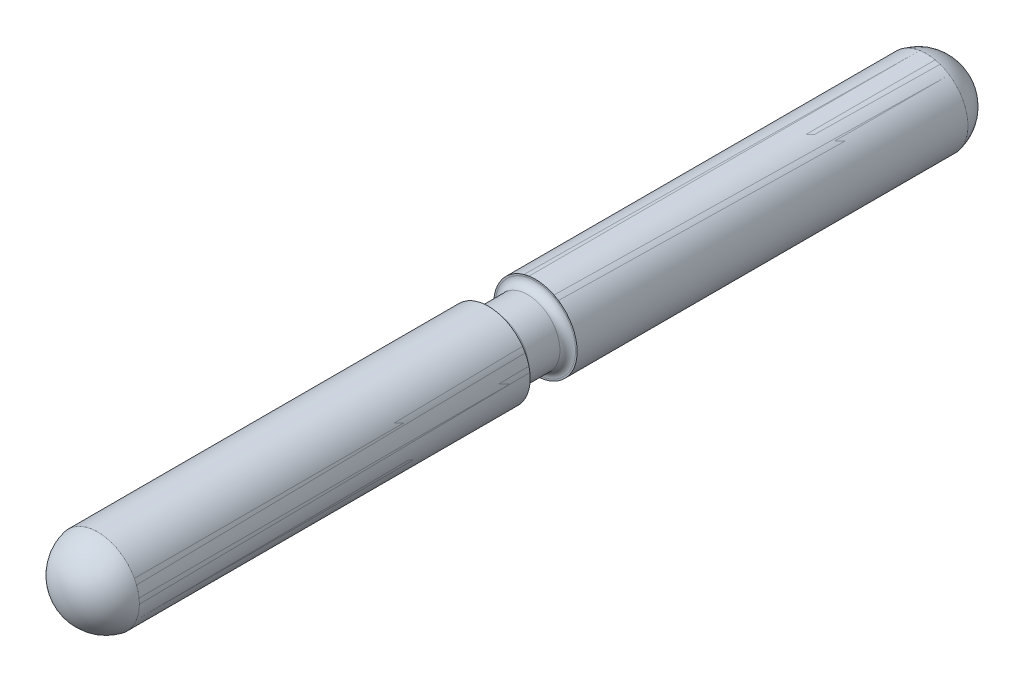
ISO-10303-21;
HEADER;
FILE_DESCRIPTION(('STEP AP214'),'2;1');
FILE_NAME('part.step','',(''),(''),'','','');
FILE_SCHEMA(('AUTOMOTIVE_DESIGN { 1 0 10303 214 1 1 1 1 }'));
ENDSEC;
DATA;
#1=APPLICATION_CONTEXT('core data for automotive mechanical design processes');
#2=APPLICATION_PROTOCOL_DEFINITION('international standard','automotive_design',2000,#1);
#3=PRODUCT_CONTEXT('',#1,'mechanical');
#4=PRODUCT('Part','Part','',(#3));
#5=PRODUCT_RELATED_PRODUCT_CATEGORY('part','',(#4));
#6=PRODUCT_DEFINITION_FORMATION('','',#4);
#7=PRODUCT_DEFINITION_CONTEXT('part definition',#1,'design');
#8=PRODUCT_DEFINITION('design','',#6,#7);
#9=PRODUCT_DEFINITION_SHAPE('','',#8);
#10=(LENGTH_UNIT() NAMED_UNIT(*) SI_UNIT(.MILLI.,.METRE.));
#11=(NAMED_UNIT(*) PLANE_ANGLE_UNIT() SI_UNIT($,.RADIAN.));
#12=(NAMED_UNIT(*) SI_UNIT($,.STERADIAN.) SOLID_ANGLE_UNIT());
#13=UNCERTAINTY_MEASURE_WITH_UNIT(LENGTH_MEASURE(1.E-05),#10,'distance_accuracy_value','');
#14=(GEOMETRIC_REPRESENTATION_CONTEXT(3) GLOBAL_UNCERTAINTY_ASSIGNED_CONTEXT((#13)) GLOBAL_UNIT_ASSIGNED_CONTEXT((#10,
#11,#12)) REPRESENTATION_CONTEXT('',''));
#15=CARTESIAN_POINT('',(0.,0.,0.));
#16=DIRECTION('',(0.,0.,1.));
#17=DIRECTION('',(1.,0.,0.));
#18=AXIS2_PLACEMENT_3D('',#15,#16,#17);
#19=CARTESIAN_POINT('',(0.14511484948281,0.,-71.983168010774));
#20=DIRECTION('',(0.,-1.,0.));
#21=DIRECTION('',(1.,0.,0.));
#22=AXIS2_PLACEMENT_3D('',#19,#20,#21);
#23=CIRCLE('',#22,8.00000000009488);
#24=TRIMMED_CURVE('',#23,(PARAMETER_VALUE(-1.58893667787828)),
(PARAMETER_VALUE(1.58893667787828)),.T.,.PARAMETER.);
#25=CARTESIAN_POINT('',(0.,0.,-71.983168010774));
#26=DIRECTION('',(0.,0.,1.));
#27=AXIS1_PLACEMENT('',#25,#26);
#28=SURFACE_OF_REVOLUTION('',#24,#27);
#29=CARTESIAN_POINT('',(0.,0.,-79.9818517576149));
#30=VERTEX_POINT('',#29);
#31=VERTEX_LOOP('',#30);
#32=FACE_BOUND('',#31,.T.);
#33=CARTESIAN_POINT('',(0.,0.,-73.5));
#34=DIRECTION('',(0.,0.,1.));
#35=DIRECTION('',(1.,0.,0.));
#36=AXIS2_PLACEMENT_3D('',#33,#34,#35);
#37=CIRCLE('',#36,8.);
#38=CARTESIAN_POINT('',(8.,0.,-73.5));
#39=VERTEX_POINT('',#38);
#40=EDGE_CURVE('P0_E46',#39,#39,#37,.T.);
#41=ORIENTED_EDGE('',*,*,#40,.F.);
#42=EDGE_LOOP('',(#41));
#43=FACE_BOUND('',#42,.T.);
#44=ADVANCED_FACE('P0_F24',(#32,#43),#28,.T.);
#45=CARTESIAN_POINT('',(0.,0.,-73.5));
#46=DIRECTION('',(0.,0.,1.));
#47=DIRECTION('',(1.,0.,0.));
#48=AXIS2_PLACEMENT_3D('',#45,#46,#47);
#49=CYLINDRICAL_SURFACE('',#48,8.);
#50=CARTESIAN_POINT('',(0.,0.,1.5));
#51=DIRECTION('',(0.,0.,1.));
#52=DIRECTION('',(1.,0.,0.));
#53=AXIS2_PLACEMENT_3D('',#50,#51,#52);
#54=CIRCLE('',#53,8.);
#55=CARTESIAN_POINT('',(8.,0.,1.5));
#56=VERTEX_POINT('',#55);
#57=EDGE_CURVE('P0_E28',#56,#56,#54,.F.);
#58=ORIENTED_EDGE('',*,*,#57,.T.);
#59=EDGE_LOOP('',(#58));
#60=FACE_BOUND('',#59,.T.);
#61=ORIENTED_EDGE('',*,*,#40,.T.);
#62=EDGE_LOOP('',(#61));
#63=FACE_BOUND('',#62,.T.);
#64=ADVANCED_FACE('P0_F42',(#60,#63),#49,.T.);
#65=CARTESIAN_POINT('',(8.096,-8.123858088,1.5));
#66=DIRECTION('',(0.,0.,-1.));
#67=DIRECTION('',(-1.,0.,0.));
#68=AXIS2_PLACEMENT_3D('',#65,#66,#67);
#69=PLANE('',#68);
#70=CARTESIAN_POINT('',(0.,0.,1.5));
#71=DIRECTION('',(0.,0.,-1.));
#72=DIRECTION('',(-1.,0.,0.));
#73=AXIS2_PLACEMENT_3D('',#70,#71,#72);
#74=CIRCLE('',#73,7.7);
#75=CARTESIAN_POINT('',(-7.7,0.,1.5));
#76=VERTEX_POINT('',#75);
#77=EDGE_CURVE('P0_E50',#76,#76,#74,.T.);
#78=ORIENTED_EDGE('',*,*,#77,.T.);
#79=EDGE_LOOP('',(#78));
#80=FACE_BOUND('',#79,.T.);
#81=ORIENTED_EDGE('',*,*,#57,.F.);
#82=EDGE_LOOP('',(#81));
#83=FACE_BOUND('',#82,.T.);
#84=ADVANCED_FACE('P0_F96',(#80,#83),#69,.F.);
#85=CARTESIAN_POINT('',(0.,-0.145114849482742,83.983168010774));
#86=DIRECTION('',(-1.,0.,0.));
#87=DIRECTION('',(0.,-1.,0.));
#88=AXIS2_PLACEMENT_3D('',#85,#86,#87);
#89=CIRCLE('',#88,8.00000000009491);
#90=TRIMMED_CURVE('',#89,(PARAMETER_VALUE(-1.58893667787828)),
(PARAMETER_VALUE(1.58893667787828)),.T.,.PARAMETER.);
#91=CARTESIAN_POINT('',(0.,0.,83.983168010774));
#92=DIRECTION('',(0.,0.,1.));
#93=AXIS1_PLACEMENT('',#91,#92);
#94=SURFACE_OF_REVOLUTION('',#90,#93);
#95=CARTESIAN_POINT('',(0.,0.,91.9818517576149));
#96=VERTEX_POINT('',#95);
#97=VERTEX_LOOP('',#96);
#98=FACE_BOUND('',#97,.T.);
#99=CARTESIAN_POINT('',(0.,0.,85.5));
#100=DIRECTION('',(0.,0.,1.));
#101=DIRECTION('',(1.,0.,0.));
#102=AXIS2_PLACEMENT_3D('',#99,#100,#101);
#103=CIRCLE('',#102,8.);
#104=CARTESIAN_POINT('',(8.,0.,85.5));
#105=VERTEX_POINT('',#104);
#106=EDGE_CURVE('P0_E52',#105,#105,#103,.F.);
#107=ORIENTED_EDGE('',*,*,#106,.F.);
#108=EDGE_LOOP('',(#107));
#109=FACE_BOUND('',#108,.T.);
#110=ADVANCED_FACE('P0_F91',(#98,#109),#94,.T.);
#111=CARTESIAN_POINT('',(0.,0.,3.));
#112=DIRECTION('',(0.,0.,-1.));
#113=DIRECTION('',(-1.,0.,0.));
#114=AXIS2_PLACEMENT_3D('',#111,#112,#113);
#115=TOROIDAL_SURFACE('',#114,7.7,1.5);
#116=CARTESIAN_POINT('',(0.,0.,3.));
#117=DIRECTION('',(0.,0.,1.));
#118=DIRECTION('',(1.,0.,0.));
#119=AXIS2_PLACEMENT_3D('',#116,#117,#118);
#120=CIRCLE('',#119,6.2);
#121=CARTESIAN_POINT('',(6.2,0.,3.));
#122=VERTEX_POINT('',#121);
#123=EDGE_CURVE('P0_E57',#122,#122,#120,.T.);
#124=ORIENTED_EDGE('',*,*,#123,.F.);
#125=EDGE_LOOP('',(#124));
#126=FACE_BOUND('',#125,.T.);
#127=ORIENTED_EDGE('',*,*,#77,.F.);
#128=EDGE_LOOP('',(#127));
#129=FACE_BOUND('',#128,.T.);
#130=ADVANCED_FACE('P0_F84',(#126,#129),#115,.F.);
#131=CARTESIAN_POINT('',(0.,0.,10.5));
#132=DIRECTION('',(0.,0.,1.));
#133=DIRECTION('',(1.,0.,0.));
#134=AXIS2_PLACEMENT_3D('',#131,#132,#133);
#135=CYLINDRICAL_SURFACE('',#134,8.);
#136=ORIENTED_EDGE('',*,*,#106,.T.);
#137=EDGE_LOOP('',(#136));
#138=FACE_BOUND('',#137,.T.);
#139=CARTESIAN_POINT('',(0.,0.,10.5));
#140=DIRECTION('',(0.,0.,1.));
#141=DIRECTION('',(1.,0.,0.));
#142=AXIS2_PLACEMENT_3D('',#139,#140,#141);
#143=CIRCLE('',#142,8.);
#144=CARTESIAN_POINT('',(8.,0.,10.5));
#145=VERTEX_POINT('',#144);
#146=EDGE_CURVE('P0_E55',#145,#145,#143,.T.);
#147=ORIENTED_EDGE('',*,*,#146,.T.);
#148=EDGE_LOOP('',(#147));
#149=FACE_BOUND('',#148,.T.);
#150=ADVANCED_FACE('P0_F82',(#138,#149),#135,.T.);
#151=CARTESIAN_POINT('',(0.,0.,3.));
#152=DIRECTION('',(0.,0.,1.));
#153=DIRECTION('',(1.,0.,0.));
#154=AXIS2_PLACEMENT_3D('',#151,#152,#153);
#155=CYLINDRICAL_SURFACE('',#154,6.2);
#156=ORIENTED_EDGE('',*,*,#123,.T.);
#157=EDGE_LOOP('',(#156));
#158=FACE_BOUND('',#157,.T.);
#159=CARTESIAN_POINT('',(0.,0.,9.));
#160=DIRECTION('',(0.,0.,-1.));
#161=DIRECTION('',(-1.,0.,0.));
#162=AXIS2_PLACEMENT_3D('',#159,#160,#161);
#163=CIRCLE('',#162,6.2);
#164=CARTESIAN_POINT('',(-6.2,0.,9.));
#165=VERTEX_POINT('',#164);
#166=EDGE_CURVE('P0_E34',#165,#165,#163,.T.);
#167=ORIENTED_EDGE('',*,*,#166,.T.);
#168=EDGE_LOOP('',(#167));
#169=FACE_BOUND('',#168,.T.);
#170=ADVANCED_FACE('P0_F71',(#158,#169),#155,.T.);
#171=CARTESIAN_POINT('',(-8.096,-8.123858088,10.5));
#172=DIRECTION('',(0.,0.,1.));
#173=DIRECTION('',(1.,0.,0.));
#174=AXIS2_PLACEMENT_3D('',#171,#172,#173);
#175=PLANE('',#174);
#176=CARTESIAN_POINT('',(0.,0.,10.5));
#177=DIRECTION('',(0.,0.,1.));
#178=DIRECTION('',(1.,0.,0.));
#179=AXIS2_PLACEMENT_3D('',#176,#177,#178);
#180=CIRCLE('',#179,7.7);
#181=CARTESIAN_POINT('',(7.7,0.,10.5));
#182=VERTEX_POINT('',#181);
#183=EDGE_CURVE('P0_E11',#182,#182,#180,.T.);
#184=ORIENTED_EDGE('',*,*,#183,.T.);
#185=EDGE_LOOP('',(#184));
#186=FACE_BOUND('',#185,.T.);
#187=ORIENTED_EDGE('',*,*,#146,.F.);
#188=EDGE_LOOP('',(#187));
#189=FACE_BOUND('',#188,.T.);
#190=ADVANCED_FACE('P0_F75',(#186,#189),#175,.F.);
#191=CARTESIAN_POINT('',(0.,0.,9.));
#192=DIRECTION('',(0.,0.,1.));
#193=DIRECTION('',(1.,0.,0.));
#194=AXIS2_PLACEMENT_3D('',#191,#192,#193);
#195=TOROIDAL_SURFACE('',#194,7.7,1.5);
#196=ORIENTED_EDGE('',*,*,#166,.F.);
#197=EDGE_LOOP('',(#196));
#198=FACE_BOUND('',#197,.T.);
#199=ORIENTED_EDGE('',*,*,#183,.F.);
#200=EDGE_LOOP('',(#199));
#201=FACE_BOUND('',#200,.T.);
#202=ADVANCED_FACE('P0_F26',(#198,#201),#195,.F.);
#203=CLOSED_SHELL('',(#44,#64,#84,#110,#130,#150,#170,#190,#202));
#204=MANIFOLD_SOLID_BREP('P0_B2',#203);
#205=CARTESIAN_POINT('',(0.14511484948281,0.,-71.983168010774));
#206=DIRECTION('',(0.,-1.,0.));
#207=DIRECTION('',(1.,0.,0.));
#208=AXIS2_PLACEMENT_3D('',#205,#206,#207);
#209=CIRCLE('',#208,8.00000000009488);
#210=TRIMMED_CURVE('',#209,(PARAMETER_VALUE(-1.58893667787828)),
(PARAMETER_VALUE(1.58893667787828)),.T.,.PARAMETER.);
#211=CARTESIAN_POINT('',(0.,0.,-71.983168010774));
#212=DIRECTION('',(0.,0.,1.));
#213=AXIS1_PLACEMENT('',#211,#212);
#214=SURFACE_OF_REVOLUTION('',#210,#213);
#215=CARTESIAN_POINT('',(0.,0.,-79.9818517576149));
#216=VERTEX_POINT('',#215);
#217=VERTEX_LOOP('',#216);
#218=FACE_BOUND('',#217,.T.);
#219=CARTESIAN_POINT('',(0.,0.,-73.5));
#220=DIRECTION('',(0.,0.,1.));
#221=DIRECTION('',(1.,0.,0.));
#222=AXIS2_PLACEMENT_3D('',#219,#220,#221);
#223=CIRCLE('',#222,8.);
#224=CARTESIAN_POINT('',(8.,0.,-73.5));
#225=VERTEX_POINT('',#224);
#226=EDGE_CURVE('P1_E36',#225,#225,#223,.T.);
#227=ORIENTED_EDGE('',*,*,#226,.F.);
#228=EDGE_LOOP('',(#227));
#229=FACE_BOUND('',#228,.T.);
#230=ADVANCED_FACE('P1_F14',(#218,#229),#214,.T.);
#231=CARTESIAN_POINT('',(0.,0.,-73.5));
#232=DIRECTION('',(0.,0.,1.));
#233=DIRECTION('',(1.,0.,0.));
#234=AXIS2_PLACEMENT_3D('',#231,#232,#233);
#235=CYLINDRICAL_SURFACE('',#234,8.);
#236=CARTESIAN_POINT('',(0.,0.,1.5));
#237=DIRECTION('',(0.,0.,1.));
#238=DIRECTION('',(1.,0.,0.));
#239=AXIS2_PLACEMENT_3D('',#236,#237,#238);
#240=CIRCLE('',#239,8.);
#241=CARTESIAN_POINT('',(8.,0.,1.5));
#242=VERTEX_POINT('',#241);
#243=EDGE_CURVE('P1_E18',#242,#242,#240,.F.);
#244=ORIENTED_EDGE('',*,*,#243,.T.);
#245=EDGE_LOOP('',(#244));
#246=FACE_BOUND('',#245,.T.);
#247=ORIENTED_EDGE('',*,*,#226,.T.);
#248=EDGE_LOOP('',(#247));
#249=FACE_BOUND('',#248,.T.);
#250=ADVANCED_FACE('P1_F32',(#246,#249),#235,.T.);
#251=CARTESIAN_POINT('',(8.096,-8.123858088,1.5));
#252=DIRECTION('',(0.,0.,-1.));
#253=DIRECTION('',(-1.,0.,0.));
#254=AXIS2_PLACEMENT_3D('',#251,#252,#253);
#255=PLANE('',#254);
#256=CARTESIAN_POINT('',(0.,0.,1.5));
#257=DIRECTION('',(0.,0.,-1.));
#258=DIRECTION('',(-1.,0.,0.));
#259=AXIS2_PLACEMENT_3D('',#256,#257,#258);
#260=CIRCLE('',#259,7.7);
#261=CARTESIAN_POINT('',(-7.7,0.,1.5));
#262=VERTEX_POINT('',#261);
#263=EDGE_CURVE('P1_E40',#262,#262,#260,.T.);
#264=ORIENTED_EDGE('',*,*,#263,.T.);
#265=EDGE_LOOP('',(#264));
#266=FACE_BOUND('',#265,.T.);
#267=ORIENTED_EDGE('',*,*,#243,.F.);
#268=EDGE_LOOP('',(#267));
#269=FACE_BOUND('',#268,.T.);
#270=ADVANCED_FACE('P1_F87',(#266,#269),#255,.F.);
#271=CARTESIAN_POINT('',(0.,-0.145114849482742,83.983168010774));
#272=DIRECTION('',(-1.,0.,0.));
#273=DIRECTION('',(0.,-1.,0.));
#274=AXIS2_PLACEMENT_3D('',#271,#272,#273);
#275=CIRCLE('',#274,8.00000000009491);
#276=TRIMMED_CURVE('',#275,(PARAMETER_VALUE(-1.58893667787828)),
(PARAMETER_VALUE(1.58893667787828)),.T.,.PARAMETER.);
#277=CARTESIAN_POINT('',(0.,0.,83.983168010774));
#278=DIRECTION('',(0.,0.,1.));
#279=AXIS1_PLACEMENT('',#277,#278);
#280=SURFACE_OF_REVOLUTION('',#276,#279);
#281=CARTESIAN_POINT('',(0.,0.,91.9818517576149));
#282=VERTEX_POINT('',#281);
#283=VERTEX_LOOP('',#282);
#284=FACE_BOUND('',#283,.T.);
#285=CARTESIAN_POINT('',(0.,0.,85.5));
#286=DIRECTION('',(0.,0.,1.));
#287=DIRECTION('',(1.,0.,0.));
#288=AXIS2_PLACEMENT_3D('',#285,#286,#287);
#289=CIRCLE('',#288,8.);
#290=CARTESIAN_POINT('',(8.,0.,85.5));
#291=VERTEX_POINT('',#290);
#292=EDGE_CURVE('P1_E42',#291,#291,#289,.F.);
#293=ORIENTED_EDGE('',*,*,#292,.F.);
#294=EDGE_LOOP('',(#293));
#295=FACE_BOUND('',#294,.T.);
#296=ADVANCED_FACE('P1_F82',(#284,#295),#280,.T.);
#297=CARTESIAN_POINT('',(0.,0.,3.));
#298=DIRECTION('',(0.,0.,-1.));
#299=DIRECTION('',(-1.,0.,0.));
#300=AXIS2_PLACEMENT_3D('',#297,#298,#299);
#301=TOROIDAL_SURFACE('',#300,7.7,1.5);
#302=CARTESIAN_POINT('',(0.,0.,3.));
#303=DIRECTION('',(0.,0.,1.));
#304=DIRECTION('',(1.,0.,0.));
#305=AXIS2_PLACEMENT_3D('',#302,#303,#304);
#306=CIRCLE('',#305,6.2);
#307=CARTESIAN_POINT('',(6.2,0.,3.));
#308=VERTEX_POINT('',#307);
#309=EDGE_CURVE('P1_E47',#308,#308,#306,.T.);
#310=ORIENTED_EDGE('',*,*,#309,.F.);
#311=EDGE_LOOP('',(#310));
#312=FACE_BOUND('',#311,.T.);
#313=ORIENTED_EDGE('',*,*,#263,.F.);
#314=EDGE_LOOP('',(#313));
#315=FACE_BOUND('',#314,.T.);
#316=ADVANCED_FACE('P1_F74',(#312,#315),#301,.F.);
#317=CARTESIAN_POINT('',(0.,0.,10.5));
#318=DIRECTION('',(0.,0.,1.));
#319=DIRECTION('',(1.,0.,0.));
#320=AXIS2_PLACEMENT_3D('',#317,#318,#319);
#321=CYLINDRICAL_SURFACE('',#320,8.);
#322=ORIENTED_EDGE('',*,*,#292,.T.);
#323=EDGE_LOOP('',(#322));
#324=FACE_BOUND('',#323,.T.);
#325=CARTESIAN_POINT('',(0.,0.,10.5));
#326=DIRECTION('',(0.,0.,1.));
#327=DIRECTION('',(1.,0.,0.));
#328=AXIS2_PLACEMENT_3D('',#325,#326,#327);
#329=CIRCLE('',#328,8.);
#330=CARTESIAN_POINT('',(8.,0.,10.5));
#331=VERTEX_POINT('',#330);
#332=EDGE_CURVE('P1_E45',#331,#331,#329,.T.);
#333=ORIENTED_EDGE('',*,*,#332,.T.);
#334=EDGE_LOOP('',(#333));
#335=FACE_BOUND('',#334,.T.);
#336=ADVANCED_FACE('P1_F72',(#324,#335),#321,.T.);
#337=CARTESIAN_POINT('',(0.,0.,3.));
#338=DIRECTION('',(0.,0.,1.));
#339=DIRECTION('',(1.,0.,0.));
#340=AXIS2_PLACEMENT_3D('',#337,#338,#339);
#341=CYLINDRICAL_SURFACE('',#340,6.2);
#342=ORIENTED_EDGE('',*,*,#309,.T.);
#343=EDGE_LOOP('',(#342));
#344=FACE_BOUND('',#343,.T.);
#345=CARTESIAN_POINT('',(0.,0.,9.));
#346=DIRECTION('',(0.,0.,-1.));
#347=DIRECTION('',(-1.,0.,0.));
#348=AXIS2_PLACEMENT_3D('',#345,#346,#347);
#349=CIRCLE('',#348,6.2);
#350=CARTESIAN_POINT('',(-6.2,0.,9.));
#351=VERTEX_POINT('',#350);
#352=EDGE_CURVE('P1_E24',#351,#351,#349,.T.);
#353=ORIENTED_EDGE('',*,*,#352,.T.);
#354=EDGE_LOOP('',(#353));
#355=FACE_BOUND('',#354,.T.);
#356=ADVANCED_FACE('P1_F61',(#344,#355),#341,.T.);
#357=CARTESIAN_POINT('',(-8.096,-8.123858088,10.5));
#358=DIRECTION('',(0.,0.,1.));
#359=DIRECTION('',(1.,0.,0.));
#360=AXIS2_PLACEMENT_3D('',#357,#358,#359);
#361=PLANE('',#360);
#362=CARTESIAN_POINT('',(0.,0.,10.5));
#363=DIRECTION('',(0.,0.,1.));
#364=DIRECTION('',(1.,0.,0.));
#365=AXIS2_PLACEMENT_3D('',#362,#363,#364);
#366=CIRCLE('',#365,7.7);
#367=CARTESIAN_POINT('',(7.7,0.,10.5));
#368=VERTEX_POINT('',#367);
#369=EDGE_CURVE('P1_E9',#368,#368,#366,.T.);
#370=ORIENTED_EDGE('',*,*,#369,.T.);
#371=EDGE_LOOP('',(#370));
#372=FACE_BOUND('',#371,.T.);
#373=ORIENTED_EDGE('',*,*,#332,.F.);
#374=EDGE_LOOP('',(#373));
#375=FACE_BOUND('',#374,.T.);
#376=ADVANCED_FACE('P1_F65',(#372,#375),#361,.F.);
#377=CARTESIAN_POINT('',(0.,0.,9.));
#378=DIRECTION('',(0.,0.,1.));
#379=DIRECTION('',(1.,0.,0.));
#380=AXIS2_PLACEMENT_3D('',#377,#378,#379);
#381=TOROIDAL_SURFACE('',#380,7.7,1.5);
#382=ORIENTED_EDGE('',*,*,#352,.F.);
#383=EDGE_LOOP('',(#382));
#384=FACE_BOUND('',#383,.T.);
#385=ORIENTED_EDGE('',*,*,#369,.F.);
#386=EDGE_LOOP('',(#385));
#387=FACE_BOUND('',#386,.T.);
#388=ADVANCED_FACE('P1_F16',(#384,#387),#381,.F.);
#389=CLOSED_SHELL('',(#230,#250,#270,#296,#316,#336,#356,#376,#388));
#390=MANIFOLD_SOLID_BREP('P1_B1',#389);
#391=ADVANCED_BREP_SHAPE_REPRESENTATION('',(#18,#204,#390),#14);
#392=SHAPE_DEFINITION_REPRESENTATION(#9,#391);
ENDSEC;
END-ISO-10303-21;
